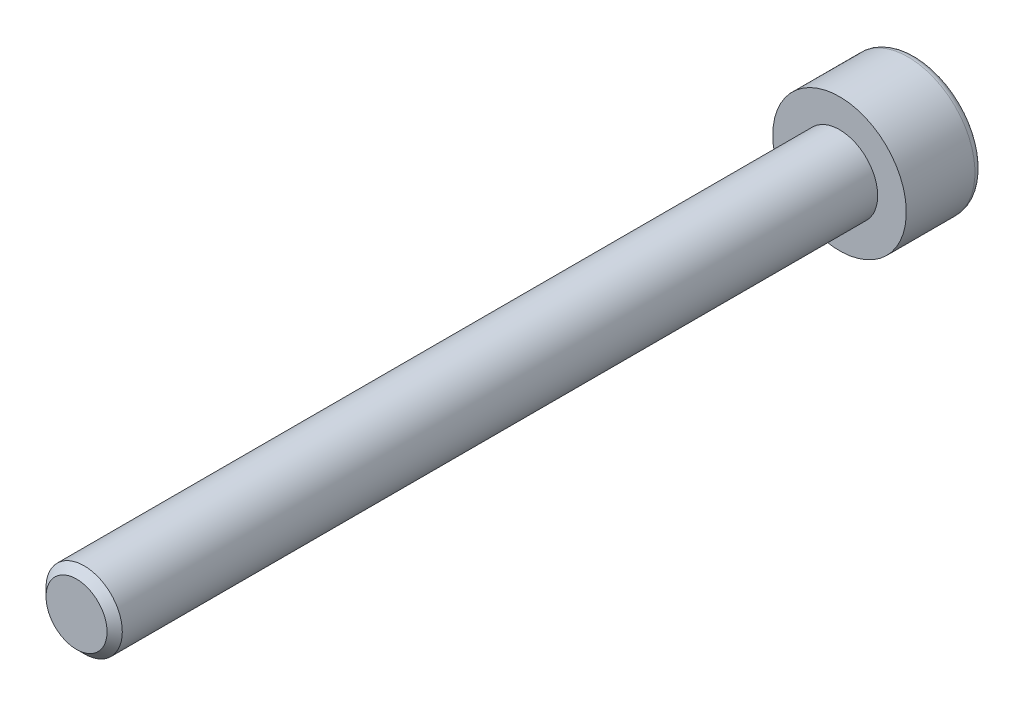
ISO-10303-21;
HEADER;
FILE_DESCRIPTION(('STEP AP214'),'2;1');
FILE_NAME('part.step','',(''),(''),'','','');
FILE_SCHEMA(('AUTOMOTIVE_DESIGN { 1 0 10303 214 1 1 1 1 }'));
ENDSEC;
DATA;
#1=APPLICATION_CONTEXT('core data for automotive mechanical design processes');
#2=APPLICATION_PROTOCOL_DEFINITION('international standard','automotive_design',2000,#1);
#3=PRODUCT_CONTEXT('',#1,'mechanical');
#4=PRODUCT('Part','Part','',(#3));
#5=PRODUCT_RELATED_PRODUCT_CATEGORY('part','',(#4));
#6=PRODUCT_DEFINITION_FORMATION('','',#4);
#7=PRODUCT_DEFINITION_CONTEXT('part definition',#1,'design');
#8=PRODUCT_DEFINITION('design','',#6,#7);
#9=PRODUCT_DEFINITION_SHAPE('','',#8);
#10=(LENGTH_UNIT() NAMED_UNIT(*) SI_UNIT(.MILLI.,.METRE.));
#11=(NAMED_UNIT(*) PLANE_ANGLE_UNIT() SI_UNIT($,.RADIAN.));
#12=(NAMED_UNIT(*) SI_UNIT($,.STERADIAN.) SOLID_ANGLE_UNIT());
#13=UNCERTAINTY_MEASURE_WITH_UNIT(LENGTH_MEASURE(1.E-05),#10,'distance_accuracy_value','');
#14=(GEOMETRIC_REPRESENTATION_CONTEXT(3) GLOBAL_UNCERTAINTY_ASSIGNED_CONTEXT((#13)) GLOBAL_UNIT_ASSIGNED_CONTEXT((#10,
#11,#12)) REPRESENTATION_CONTEXT('',''));
#15=CARTESIAN_POINT('',(0.,0.,0.));
#16=DIRECTION('',(0.,0.,1.));
#17=DIRECTION('',(1.,0.,0.));
#18=AXIS2_PLACEMENT_3D('',#15,#16,#17);
#19=CARTESIAN_POINT('',(0.,0.,-4.));
#20=DIRECTION('',(0.,0.,1.));
#21=DIRECTION('',(1.,0.,0.));
#22=AXIS2_PLACEMENT_3D('',#19,#20,#21);
#23=PLANE('',#22);
#24=CARTESIAN_POINT('',(0.,0.,-4.));
#25=DIRECTION('',(0.,0.,-1.));
#26=DIRECTION('',(-1.,0.,0.));
#27=AXIS2_PLACEMENT_3D('',#24,#25,#26);
#28=CIRCLE('',#27,3.1);
#29=CARTESIAN_POINT('',(-3.1,0.,-4.));
#30=VERTEX_POINT('',#29);
#31=EDGE_CURVE('E140',#30,#30,#28,.T.);
#32=ORIENTED_EDGE('',*,*,#31,.T.);
#33=EDGE_LOOP('',(#32));
#34=FACE_BOUND('',#33,.T.);
#35=DIRECTION('',(-0.866025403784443,0.5,0.));
#36=VECTOR('',#35,1.);
#37=CARTESIAN_POINT('',(0.,1.73205080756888,-4.));
#38=LINE('',#37,#36);
#39=CARTESIAN_POINT('',(1.50000000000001,0.866025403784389,-4.));
#40=VERTEX_POINT('',#39);
#41=CARTESIAN_POINT('',(0.,1.73205080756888,-4.));
#42=VERTEX_POINT('',#41);
#43=EDGE_CURVE('E44',#40,#42,#38,.T.);
#44=ORIENTED_EDGE('',*,*,#43,.T.);
#45=DIRECTION('',(-0.866025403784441,-0.500000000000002,0.));
#46=VECTOR('',#45,1.);
#47=CARTESIAN_POINT('',(0.,1.73205080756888,-4.));
#48=LINE('',#47,#46);
#49=CARTESIAN_POINT('',(-1.50000000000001,0.866025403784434,-4.));
#50=VERTEX_POINT('',#49);
#51=EDGE_CURVE('E84',#42,#50,#48,.T.);
#52=ORIENTED_EDGE('',*,*,#51,.T.);
#53=DIRECTION('',(0.,-1.,0.));
#54=VECTOR('',#53,1.);
#55=CARTESIAN_POINT('',(-1.50000000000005,-0.866025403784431,-4.));
#56=LINE('',#55,#54);
#57=CARTESIAN_POINT('',(-1.50000000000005,-0.866025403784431,-4.));
#58=VERTEX_POINT('',#57);
#59=EDGE_CURVE('E92',#50,#58,#56,.T.);
#60=ORIENTED_EDGE('',*,*,#59,.T.);
#61=DIRECTION('',(0.86602540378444,-0.500000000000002,0.));
#62=VECTOR('',#61,1.);
#63=CARTESIAN_POINT('',(0.,-1.73205080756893,-4.));
#64=LINE('',#63,#62);
#65=CARTESIAN_POINT('',(0.,-1.73205080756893,-4.));
#66=VERTEX_POINT('',#65);
#67=EDGE_CURVE('E110',#58,#66,#64,.T.);
#68=ORIENTED_EDGE('',*,*,#67,.T.);
#69=DIRECTION('',(0.866025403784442,0.499999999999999,0.));
#70=VECTOR('',#69,1.);
#71=CARTESIAN_POINT('',(0.,-1.73205080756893,-4.));
#72=LINE('',#71,#70);
#73=CARTESIAN_POINT('',(1.49999999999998,-0.866025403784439,-4.));
#74=VERTEX_POINT('',#73);
#75=EDGE_CURVE('E113',#66,#74,#72,.T.);
#76=ORIENTED_EDGE('',*,*,#75,.T.);
#77=DIRECTION('',(0.,1.,0.));
#78=VECTOR('',#77,1.);
#79=CARTESIAN_POINT('',(1.49999999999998,-0.866025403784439,-4.));
#80=LINE('',#79,#78);
#81=EDGE_CURVE('E103',#74,#40,#80,.T.);
#82=ORIENTED_EDGE('',*,*,#81,.T.);
#83=EDGE_LOOP('',(#44,#52,#60,#68,#76,#82));
#84=FACE_BOUND('',#83,.T.);
#85=ADVANCED_FACE('F30',(#34,#84),#23,.F.);
#86=CARTESIAN_POINT('',(0.,0.,-3.60000000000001));
#87=DIRECTION('',(0.,0.,-1.));
#88=DIRECTION('',(-1.,0.,0.));
#89=AXIS2_PLACEMENT_3D('',#86,#87,#88);
#90=TOROIDAL_SURFACE('',#89,3.1,0.4);
#91=ORIENTED_EDGE('',*,*,#31,.F.);
#92=EDGE_LOOP('',(#91));
#93=FACE_BOUND('',#92,.T.);
#94=CARTESIAN_POINT('',(0.,0.,-3.60000000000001));
#95=DIRECTION('',(0.,0.,-1.));
#96=DIRECTION('',(-1.,0.,0.));
#97=AXIS2_PLACEMENT_3D('',#94,#95,#96);
#98=CIRCLE('',#97,3.5);
#99=CARTESIAN_POINT('',(-3.50000000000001,0.,-3.60000000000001));
#100=VERTEX_POINT('',#99);
#101=EDGE_CURVE('E137',#100,#100,#98,.T.);
#102=ORIENTED_EDGE('',*,*,#101,.T.);
#103=EDGE_LOOP('',(#102));
#104=FACE_BOUND('',#103,.T.);
#105=ADVANCED_FACE('F159',(#93,#104),#90,.T.);
#106=CARTESIAN_POINT('',(0.,0.,0.));
#107=DIRECTION('',(0.,0.,-1.));
#108=DIRECTION('',(-1.,0.,0.));
#109=AXIS2_PLACEMENT_3D('',#106,#107,#108);
#110=CYLINDRICAL_SURFACE('',#109,3.5);
#111=ORIENTED_EDGE('',*,*,#101,.F.);
#112=EDGE_LOOP('',(#111));
#113=FACE_BOUND('',#112,.T.);
#114=CARTESIAN_POINT('',(0.,0.,0.));
#115=DIRECTION('',(0.,0.,-1.));
#116=DIRECTION('',(-1.,0.,0.));
#117=AXIS2_PLACEMENT_3D('',#114,#115,#116);
#118=CIRCLE('',#117,3.5);
#119=CARTESIAN_POINT('',(-3.50000000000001,0.,0.));
#120=VERTEX_POINT('',#119);
#121=EDGE_CURVE('E98',#120,#120,#118,.T.);
#122=ORIENTED_EDGE('',*,*,#121,.T.);
#123=EDGE_LOOP('',(#122));
#124=FACE_BOUND('',#123,.T.);
#125=ADVANCED_FACE('F164',(#113,#124),#110,.T.);
#126=CARTESIAN_POINT('',(0.,0.,0.));
#127=DIRECTION('',(0.,0.,-1.));
#128=DIRECTION('',(-1.,0.,0.));
#129=AXIS2_PLACEMENT_3D('',#126,#127,#128);
#130=PLANE('',#129);
#131=CARTESIAN_POINT('',(0.,0.,0.));
#132=DIRECTION('',(0.,0.,1.));
#133=DIRECTION('',(1.,0.,0.));
#134=AXIS2_PLACEMENT_3D('',#131,#132,#133);
#135=CIRCLE('',#134,2.);
#136=CARTESIAN_POINT('',(2.00000000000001,0.,0.));
#137=VERTEX_POINT('',#136);
#138=EDGE_CURVE('E104',#137,#137,#135,.T.);
#139=ORIENTED_EDGE('',*,*,#138,.F.);
#140=EDGE_LOOP('',(#139));
#141=FACE_BOUND('',#140,.T.);
#142=ORIENTED_EDGE('',*,*,#121,.F.);
#143=EDGE_LOOP('',(#142));
#144=FACE_BOUND('',#143,.T.);
#145=ADVANCED_FACE('F172',(#141,#144),#130,.F.);
#146=CARTESIAN_POINT('',(0.,1.73205080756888,-2.));
#147=DIRECTION('',(-0.5,-0.866025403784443,0.));
#148=DIRECTION('',(0.866025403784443,-0.5,0.));
#149=AXIS2_PLACEMENT_3D('',#146,#147,#148);
#150=PLANE('',#149);
#151=ORIENTED_EDGE('',*,*,#43,.F.);
#152=DIRECTION('',(0.,0.,-1.));
#153=VECTOR('',#152,1.);
#154=CARTESIAN_POINT('',(1.50000000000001,0.86602540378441,-2.));
#155=LINE('',#154,#153);
#156=CARTESIAN_POINT('',(1.50000000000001,0.86602540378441,-2.));
#157=VERTEX_POINT('',#156);
#158=EDGE_CURVE('E126',#157,#40,#155,.T.);
#159=ORIENTED_EDGE('',*,*,#158,.F.);
#160=DIRECTION('',(-0.866025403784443,0.5,0.));
#161=VECTOR('',#160,1.);
#162=CARTESIAN_POINT('',(0.,1.73205080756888,-2.));
#163=LINE('',#162,#161);
#164=CARTESIAN_POINT('',(0.,1.73205080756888,-2.));
#165=VERTEX_POINT('',#164);
#166=EDGE_CURVE('E97',#157,#165,#163,.T.);
#167=ORIENTED_EDGE('',*,*,#166,.T.);
#168=DIRECTION('',(0.,0.,-1.));
#169=VECTOR('',#168,1.);
#170=CARTESIAN_POINT('',(0.,1.73205080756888,-2.));
#171=LINE('',#170,#169);
#172=EDGE_CURVE('E86',#165,#42,#171,.T.);
#173=ORIENTED_EDGE('',*,*,#172,.T.);
#174=EDGE_LOOP('',(#151,#159,#167,#173));
#175=FACE_BOUND('',#174,.T.);
#176=ADVANCED_FACE('F95',(#175),#150,.T.);
#177=CARTESIAN_POINT('',(0.,1.73205080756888,-2.));
#178=DIRECTION('',(0.500000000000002,-0.866025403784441,0.));
#179=DIRECTION('',(0.866025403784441,0.500000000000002,0.));
#180=AXIS2_PLACEMENT_3D('',#177,#178,#179);
#181=PLANE('',#180);
#182=ORIENTED_EDGE('',*,*,#51,.F.);
#183=ORIENTED_EDGE('',*,*,#172,.F.);
#184=DIRECTION('',(-0.866025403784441,-0.500000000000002,0.));
#185=VECTOR('',#184,1.);
#186=CARTESIAN_POINT('',(0.,1.73205080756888,-2.));
#187=LINE('',#186,#185);
#188=CARTESIAN_POINT('',(-1.50000000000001,0.866025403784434,-2.));
#189=VERTEX_POINT('',#188);
#190=EDGE_CURVE('E117',#165,#189,#187,.T.);
#191=ORIENTED_EDGE('',*,*,#190,.T.);
#192=DIRECTION('',(0.,0.,-1.));
#193=VECTOR('',#192,1.);
#194=CARTESIAN_POINT('',(-1.50000000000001,0.866025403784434,-2.));
#195=LINE('',#194,#193);
#196=EDGE_CURVE('E88',#189,#50,#195,.T.);
#197=ORIENTED_EDGE('',*,*,#196,.T.);
#198=EDGE_LOOP('',(#182,#183,#191,#197));
#199=FACE_BOUND('',#198,.T.);
#200=ADVANCED_FACE('F85',(#199),#181,.T.);
#201=CARTESIAN_POINT('',(-1.49999999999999,-0.866025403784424,-2.));
#202=DIRECTION('',(1.,0.,0.));
#203=DIRECTION('',(0.,0.,-1.));
#204=AXIS2_PLACEMENT_3D('',#201,#202,#203);
#205=PLANE('',#204);
#206=ORIENTED_EDGE('',*,*,#59,.F.);
#207=ORIENTED_EDGE('',*,*,#196,.F.);
#208=DIRECTION('',(0.,-1.,0.));
#209=VECTOR('',#208,1.);
#210=CARTESIAN_POINT('',(-1.49999999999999,-0.866025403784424,-2.));
#211=LINE('',#210,#209);
#212=CARTESIAN_POINT('',(-1.49999999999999,-0.866025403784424,-2.));
#213=VERTEX_POINT('',#212);
#214=EDGE_CURVE('E119',#189,#213,#211,.T.);
#215=ORIENTED_EDGE('',*,*,#214,.T.);
#216=DIRECTION('',(0.,0.,-1.));
#217=VECTOR('',#216,1.);
#218=CARTESIAN_POINT('',(-1.49999999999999,-0.866025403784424,-2.));
#219=LINE('',#218,#217);
#220=EDGE_CURVE('E132',#213,#58,#219,.T.);
#221=ORIENTED_EDGE('',*,*,#220,.T.);
#222=EDGE_LOOP('',(#206,#207,#215,#221));
#223=FACE_BOUND('',#222,.T.);
#224=ADVANCED_FACE('F187',(#223),#205,.T.);
#225=CARTESIAN_POINT('',(0.,-1.7320508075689,-2.));
#226=DIRECTION('',(0.500000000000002,0.86602540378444,0.));
#227=DIRECTION('',(-0.86602540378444,0.500000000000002,0.));
#228=AXIS2_PLACEMENT_3D('',#225,#226,#227);
#229=PLANE('',#228);
#230=ORIENTED_EDGE('',*,*,#67,.F.);
#231=ORIENTED_EDGE('',*,*,#220,.F.);
#232=DIRECTION('',(0.86602540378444,-0.500000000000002,0.));
#233=VECTOR('',#232,1.);
#234=CARTESIAN_POINT('',(0.,-1.7320508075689,-2.));
#235=LINE('',#234,#233);
#236=CARTESIAN_POINT('',(0.,-1.7320508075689,-2.));
#237=VERTEX_POINT('',#236);
#238=EDGE_CURVE('E121',#213,#237,#235,.T.);
#239=ORIENTED_EDGE('',*,*,#238,.T.);
#240=DIRECTION('',(0.,0.,-1.));
#241=VECTOR('',#240,1.);
#242=CARTESIAN_POINT('',(0.,-1.7320508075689,-2.));
#243=LINE('',#242,#241);
#244=EDGE_CURVE('E130',#237,#66,#243,.T.);
#245=ORIENTED_EDGE('',*,*,#244,.T.);
#246=EDGE_LOOP('',(#230,#231,#239,#245));
#247=FACE_BOUND('',#246,.T.);
#248=ADVANCED_FACE('F190',(#247),#229,.T.);
#249=CARTESIAN_POINT('',(0.,-1.7320508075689,-2.));
#250=DIRECTION('',(-0.499999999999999,0.866025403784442,0.));
#251=DIRECTION('',(-0.866025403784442,-0.499999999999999,0.));
#252=AXIS2_PLACEMENT_3D('',#249,#250,#251);
#253=PLANE('',#252);
#254=ORIENTED_EDGE('',*,*,#75,.F.);
#255=ORIENTED_EDGE('',*,*,#244,.F.);
#256=DIRECTION('',(0.866025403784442,0.499999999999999,0.));
#257=VECTOR('',#256,1.);
#258=CARTESIAN_POINT('',(0.,-1.7320508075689,-2.));
#259=LINE('',#258,#257);
#260=CARTESIAN_POINT('',(1.49999999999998,-0.866025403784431,-2.));
#261=VERTEX_POINT('',#260);
#262=EDGE_CURVE('E123',#237,#261,#259,.T.);
#263=ORIENTED_EDGE('',*,*,#262,.T.);
#264=DIRECTION('',(0.,0.,-1.));
#265=VECTOR('',#264,1.);
#266=CARTESIAN_POINT('',(1.49999999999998,-0.866025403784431,-2.));
#267=LINE('',#266,#265);
#268=EDGE_CURVE('E128',#261,#74,#267,.T.);
#269=ORIENTED_EDGE('',*,*,#268,.T.);
#270=EDGE_LOOP('',(#254,#255,#263,#269));
#271=FACE_BOUND('',#270,.T.);
#272=ADVANCED_FACE('F194',(#271),#253,.T.);
#273=CARTESIAN_POINT('',(1.49999999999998,-0.866025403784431,-2.));
#274=DIRECTION('',(-1.,0.,0.));
#275=DIRECTION('',(0.,0.,1.));
#276=AXIS2_PLACEMENT_3D('',#273,#274,#275);
#277=PLANE('',#276);
#278=ORIENTED_EDGE('',*,*,#81,.F.);
#279=ORIENTED_EDGE('',*,*,#268,.F.);
#280=DIRECTION('',(0.,1.,0.));
#281=VECTOR('',#280,1.);
#282=CARTESIAN_POINT('',(1.49999999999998,-0.866025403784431,-2.));
#283=LINE('',#282,#281);
#284=EDGE_CURVE('E51',#261,#157,#283,.T.);
#285=ORIENTED_EDGE('',*,*,#284,.T.);
#286=ORIENTED_EDGE('',*,*,#158,.T.);
#287=EDGE_LOOP('',(#278,#279,#285,#286));
#288=FACE_BOUND('',#287,.T.);
#289=ADVANCED_FACE('F198',(#288),#277,.T.);
#290=CARTESIAN_POINT('',(1.50000000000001,0.86602540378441,-2.));
#291=DIRECTION('',(0.,0.,1.));
#292=DIRECTION('',(1.,0.,0.));
#293=AXIS2_PLACEMENT_3D('',#290,#291,#292);
#294=PLANE('',#293);
#295=ORIENTED_EDGE('',*,*,#166,.F.);
#296=ORIENTED_EDGE('',*,*,#284,.F.);
#297=ORIENTED_EDGE('',*,*,#262,.F.);
#298=ORIENTED_EDGE('',*,*,#238,.F.);
#299=ORIENTED_EDGE('',*,*,#214,.F.);
#300=ORIENTED_EDGE('',*,*,#190,.F.);
#301=EDGE_LOOP('',(#295,#296,#297,#298,#299,#300));
#302=FACE_BOUND('',#301,.T.);
#303=ADVANCED_FACE('F202',(#302),#294,.F.);
#304=CARTESIAN_POINT('',(0.,0.,40.));
#305=DIRECTION('',(0.,0.,1.));
#306=DIRECTION('',(1.,0.,0.));
#307=AXIS2_PLACEMENT_3D('',#304,#305,#306);
#308=PLANE('',#307);
#309=CARTESIAN_POINT('',(0.,0.,40.));
#310=DIRECTION('',(0.,0.,1.));
#311=DIRECTION('',(1.,0.,0.));
#312=AXIS2_PLACEMENT_3D('',#309,#310,#311);
#313=CIRCLE('',#312,1.59999999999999);
#314=CARTESIAN_POINT('',(1.6,0.,40.));
#315=VERTEX_POINT('',#314);
#316=EDGE_CURVE('E37',#315,#315,#313,.T.);
#317=ORIENTED_EDGE('',*,*,#316,.T.);
#318=EDGE_LOOP('',(#317));
#319=FACE_BOUND('',#318,.T.);
#320=ADVANCED_FACE('F145',(#319),#308,.T.);
#321=CARTESIAN_POINT('',(0.,0.,0.));
#322=DIRECTION('',(0.,0.,1.));
#323=DIRECTION('',(1.,0.,0.));
#324=AXIS2_PLACEMENT_3D('',#321,#322,#323);
#325=CYLINDRICAL_SURFACE('',#324,2.);
#326=CARTESIAN_POINT('',(0.,0.,39.6));
#327=DIRECTION('',(0.,0.,1.));
#328=DIRECTION('',(1.,0.,0.));
#329=AXIS2_PLACEMENT_3D('',#326,#327,#328);
#330=CIRCLE('',#329,2.);
#331=CARTESIAN_POINT('',(2.00000000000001,0.,39.6));
#332=VERTEX_POINT('',#331);
#333=EDGE_CURVE('E11',#332,#332,#330,.F.);
#334=ORIENTED_EDGE('',*,*,#333,.T.);
#335=EDGE_LOOP('',(#334));
#336=FACE_BOUND('',#335,.T.);
#337=ORIENTED_EDGE('',*,*,#138,.T.);
#338=EDGE_LOOP('',(#337));
#339=FACE_BOUND('',#338,.T.);
#340=ADVANCED_FACE('F149',(#336,#339),#325,.T.);
#341=CARTESIAN_POINT('',(0.,0.,40.));
#342=DIRECTION('',(0.,0.,-1.));
#343=DIRECTION('',(-1.,0.,0.));
#344=AXIS2_PLACEMENT_3D('',#341,#342,#343);
#345=CONICAL_SURFACE('',#344,1.59999999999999,0.785398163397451);
#346=ORIENTED_EDGE('',*,*,#333,.F.);
#347=EDGE_LOOP('',(#346));
#348=FACE_BOUND('',#347,.T.);
#349=ORIENTED_EDGE('',*,*,#316,.F.);
#350=EDGE_LOOP('',(#349));
#351=FACE_BOUND('',#350,.T.);
#352=ADVANCED_FACE('F147',(#348,#351),#345,.T.);
#353=CLOSED_SHELL('',(#85,#105,#125,#145,#176,#200,#224,#248,#272,#289,#303,#320,#340,#352));
#354=MANIFOLD_SOLID_BREP('B2',#353);
#355=ADVANCED_BREP_SHAPE_REPRESENTATION('',(#18,#354),#14);
#356=SHAPE_DEFINITION_REPRESENTATION(#9,#355);
ENDSEC;
END-ISO-10303-21;
